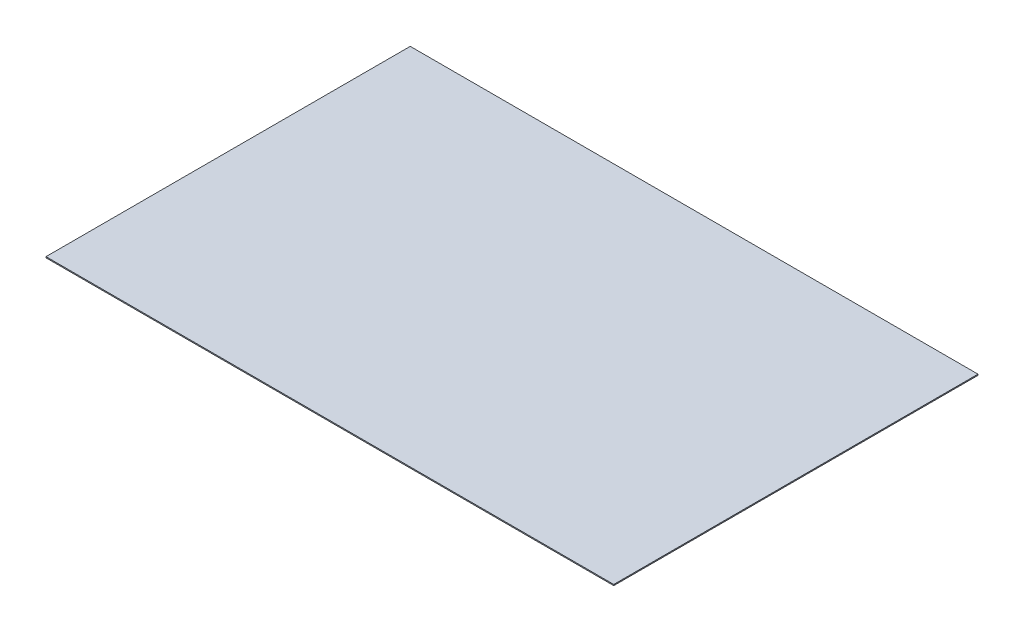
ISO-10303-21;
HEADER;
FILE_DESCRIPTION(('STEP AP214'),'2;1');
FILE_NAME('part.step','',(''),(''),'','','');
FILE_SCHEMA(('AUTOMOTIVE_DESIGN { 1 0 10303 214 1 1 1 1 }'));
ENDSEC;
DATA;
#1=APPLICATION_CONTEXT('core data for automotive mechanical design processes');
#2=APPLICATION_PROTOCOL_DEFINITION('international standard','automotive_design',2000,#1);
#3=PRODUCT_CONTEXT('',#1,'mechanical');
#4=PRODUCT('Part','Part','',(#3));
#5=PRODUCT_RELATED_PRODUCT_CATEGORY('part','',(#4));
#6=PRODUCT_DEFINITION_FORMATION('','',#4);
#7=PRODUCT_DEFINITION_CONTEXT('part definition',#1,'design');
#8=PRODUCT_DEFINITION('design','',#6,#7);
#9=PRODUCT_DEFINITION_SHAPE('','',#8);
#10=(LENGTH_UNIT() NAMED_UNIT(*) SI_UNIT(.MILLI.,.METRE.));
#11=(NAMED_UNIT(*) PLANE_ANGLE_UNIT() SI_UNIT($,.RADIAN.));
#12=(NAMED_UNIT(*) SI_UNIT($,.STERADIAN.) SOLID_ANGLE_UNIT());
#13=UNCERTAINTY_MEASURE_WITH_UNIT(LENGTH_MEASURE(1.E-05),#10,'distance_accuracy_value','');
#14=(GEOMETRIC_REPRESENTATION_CONTEXT(3) GLOBAL_UNCERTAINTY_ASSIGNED_CONTEXT((#13)) GLOBAL_UNIT_ASSIGNED_CONTEXT((#10,
#11,#12)) REPRESENTATION_CONTEXT('',''));
#15=CARTESIAN_POINT('',(0.,0.,0.));
#16=DIRECTION('',(0.,0.,1.));
#17=DIRECTION('',(1.,0.,0.));
#18=AXIS2_PLACEMENT_3D('',#15,#16,#17);
#19=CARTESIAN_POINT('',(-132.816653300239,2.54,-41.6142234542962));
#20=DIRECTION('',(1.,0.,0.));
#21=DIRECTION('',(0.,0.,-1.));
#22=AXIS2_PLACEMENT_3D('',#19,#20,#21);
#23=PLANE('',#22);
#24=DIRECTION('',(0.,0.,1.));
#25=VECTOR('',#24,1.);
#26=CARTESIAN_POINT('',(-132.816653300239,0.,-41.6142234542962));
#27=LINE('',#26,#25);
#28=CARTESIAN_POINT('',(-132.816653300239,0.,-41.6142234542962));
#29=VERTEX_POINT('',#28);
#30=CARTESIAN_POINT('',(-132.816653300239,0.,821.985776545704));
#31=VERTEX_POINT('',#30);
#32=EDGE_CURVE('E94',#29,#31,#27,.T.);
#33=ORIENTED_EDGE('',*,*,#32,.T.);
#34=DIRECTION('',(0.,-1.,0.));
#35=VECTOR('',#34,1.);
#36=CARTESIAN_POINT('',(-132.816653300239,2.54,821.985776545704));
#37=LINE('',#36,#35);
#38=CARTESIAN_POINT('',(-132.816653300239,2.54,821.985776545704));
#39=VERTEX_POINT('',#38);
#40=EDGE_CURVE('E11',#39,#31,#37,.T.);
#41=ORIENTED_EDGE('',*,*,#40,.F.);
#42=DIRECTION('',(0.,0.,1.));
#43=VECTOR('',#42,1.);
#44=CARTESIAN_POINT('',(-132.816653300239,2.54,-41.6142234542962));
#45=LINE('',#44,#43);
#46=CARTESIAN_POINT('',(-132.816653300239,2.54,-41.6142234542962));
#47=VERTEX_POINT('',#46);
#48=EDGE_CURVE('E82',#47,#39,#45,.T.);
#49=ORIENTED_EDGE('',*,*,#48,.F.);
#50=DIRECTION('',(0.,-1.,0.));
#51=VECTOR('',#50,1.);
#52=CARTESIAN_POINT('',(-132.816653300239,2.54,-41.6142234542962));
#53=LINE('',#52,#51);
#54=EDGE_CURVE('E90',#47,#29,#53,.T.);
#55=ORIENTED_EDGE('',*,*,#54,.T.);
#56=EDGE_LOOP('',(#33,#41,#49,#55));
#57=FACE_BOUND('',#56,.T.);
#58=ADVANCED_FACE('F31',(#57),#23,.F.);
#59=CARTESIAN_POINT('',(-132.816653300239,2.54,821.985776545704));
#60=DIRECTION('',(0.,0.,-1.));
#61=DIRECTION('',(-1.,0.,0.));
#62=AXIS2_PLACEMENT_3D('',#59,#60,#61);
#63=PLANE('',#62);
#64=DIRECTION('',(1.,0.,0.));
#65=VECTOR('',#64,1.);
#66=CARTESIAN_POINT('',(-132.816653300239,0.,821.985776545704));
#67=LINE('',#66,#65);
#68=CARTESIAN_POINT('',(1213.38334669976,0.,821.985776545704));
#69=VERTEX_POINT('',#68);
#70=EDGE_CURVE('E86',#31,#69,#67,.T.);
#71=ORIENTED_EDGE('',*,*,#70,.T.);
#72=DIRECTION('',(0.,-1.,0.));
#73=VECTOR('',#72,1.);
#74=CARTESIAN_POINT('',(1213.38334669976,2.54,821.985776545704));
#75=LINE('',#74,#73);
#76=CARTESIAN_POINT('',(1213.38334669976,2.54,821.985776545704));
#77=VERTEX_POINT('',#76);
#78=EDGE_CURVE('E39',#77,#69,#75,.T.);
#79=ORIENTED_EDGE('',*,*,#78,.F.);
#80=DIRECTION('',(1.,0.,0.));
#81=VECTOR('',#80,1.);
#82=CARTESIAN_POINT('',(-132.816653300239,2.54,821.985776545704));
#83=LINE('',#82,#81);
#84=EDGE_CURVE('E77',#39,#77,#83,.T.);
#85=ORIENTED_EDGE('',*,*,#84,.F.);
#86=ORIENTED_EDGE('',*,*,#40,.T.);
#87=EDGE_LOOP('',(#71,#79,#85,#86));
#88=FACE_BOUND('',#87,.T.);
#89=ADVANCED_FACE('F85',(#88),#63,.F.);
#90=CARTESIAN_POINT('',(1213.38334669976,2.54,-41.6142234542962));
#91=DIRECTION('',(-1.,0.,0.));
#92=DIRECTION('',(0.,0.,1.));
#93=AXIS2_PLACEMENT_3D('',#90,#91,#92);
#94=PLANE('',#93);
#95=DIRECTION('',(0.,0.,-1.));
#96=VECTOR('',#95,1.);
#97=CARTESIAN_POINT('',(1213.38334669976,0.,-41.6142234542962));
#98=LINE('',#97,#96);
#99=CARTESIAN_POINT('',(1213.38334669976,0.,-41.6142234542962));
#100=VERTEX_POINT('',#99);
#101=EDGE_CURVE('E64',#69,#100,#98,.T.);
#102=ORIENTED_EDGE('',*,*,#101,.T.);
#103=DIRECTION('',(0.,-1.,0.));
#104=VECTOR('',#103,1.);
#105=CARTESIAN_POINT('',(1213.38334669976,2.54,-41.6142234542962));
#106=LINE('',#105,#104);
#107=CARTESIAN_POINT('',(1213.38334669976,2.54,-41.6142234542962));
#108=VERTEX_POINT('',#107);
#109=EDGE_CURVE('E87',#108,#100,#106,.T.);
#110=ORIENTED_EDGE('',*,*,#109,.F.);
#111=DIRECTION('',(0.,0.,-1.));
#112=VECTOR('',#111,1.);
#113=CARTESIAN_POINT('',(1213.38334669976,2.54,-41.6142234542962));
#114=LINE('',#113,#112);
#115=EDGE_CURVE('E80',#77,#108,#114,.T.);
#116=ORIENTED_EDGE('',*,*,#115,.F.);
#117=ORIENTED_EDGE('',*,*,#78,.T.);
#118=EDGE_LOOP('',(#102,#110,#116,#117));
#119=FACE_BOUND('',#118,.T.);
#120=ADVANCED_FACE('F88',(#119),#94,.F.);
#121=CARTESIAN_POINT('',(-132.816653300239,2.54,-41.6142234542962));
#122=DIRECTION('',(0.,0.,1.));
#123=DIRECTION('',(1.,0.,0.));
#124=AXIS2_PLACEMENT_3D('',#121,#122,#123);
#125=PLANE('',#124);
#126=DIRECTION('',(-1.,0.,0.));
#127=VECTOR('',#126,1.);
#128=CARTESIAN_POINT('',(-132.816653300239,0.,-41.6142234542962));
#129=LINE('',#128,#127);
#130=EDGE_CURVE('E70',#100,#29,#129,.T.);
#131=ORIENTED_EDGE('',*,*,#130,.T.);
#132=ORIENTED_EDGE('',*,*,#54,.F.);
#133=DIRECTION('',(-1.,0.,0.));
#134=VECTOR('',#133,1.);
#135=CARTESIAN_POINT('',(-132.816653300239,2.54,-41.6142234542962));
#136=LINE('',#135,#134);
#137=EDGE_CURVE('E47',#108,#47,#136,.T.);
#138=ORIENTED_EDGE('',*,*,#137,.F.);
#139=ORIENTED_EDGE('',*,*,#109,.T.);
#140=EDGE_LOOP('',(#131,#132,#138,#139));
#141=FACE_BOUND('',#140,.T.);
#142=ADVANCED_FACE('F101',(#141),#125,.F.);
#143=CARTESIAN_POINT('',(-132.816653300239,2.54,821.985776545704));
#144=DIRECTION('',(0.,1.,0.));
#145=DIRECTION('',(0.,0.,1.));
#146=AXIS2_PLACEMENT_3D('',#143,#144,#145);
#147=PLANE('',#146);
#148=ORIENTED_EDGE('',*,*,#48,.T.);
#149=ORIENTED_EDGE('',*,*,#84,.T.);
#150=ORIENTED_EDGE('',*,*,#115,.T.);
#151=ORIENTED_EDGE('',*,*,#137,.T.);
#152=EDGE_LOOP('',(#148,#149,#150,#151));
#153=FACE_BOUND('',#152,.T.);
#154=ADVANCED_FACE('F78',(#153),#147,.T.);
#155=CARTESIAN_POINT('',(-132.816653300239,0.,821.985776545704));
#156=DIRECTION('',(0.,1.,0.));
#157=DIRECTION('',(0.,0.,1.));
#158=AXIS2_PLACEMENT_3D('',#155,#156,#157);
#159=PLANE('',#158);
#160=ORIENTED_EDGE('',*,*,#32,.F.);
#161=ORIENTED_EDGE('',*,*,#130,.F.);
#162=ORIENTED_EDGE('',*,*,#101,.F.);
#163=ORIENTED_EDGE('',*,*,#70,.F.);
#164=EDGE_LOOP('',(#160,#161,#162,#163));
#165=FACE_BOUND('',#164,.T.);
#166=ADVANCED_FACE('F104',(#165),#159,.F.);
#167=CLOSED_SHELL('',(#58,#89,#120,#142,#154,#166));
#168=MANIFOLD_SOLID_BREP('B2',#167);
#169=ADVANCED_BREP_SHAPE_REPRESENTATION('',(#18,#168),#14);
#170=SHAPE_DEFINITION_REPRESENTATION(#9,#169);
ENDSEC;
END-ISO-10303-21;
